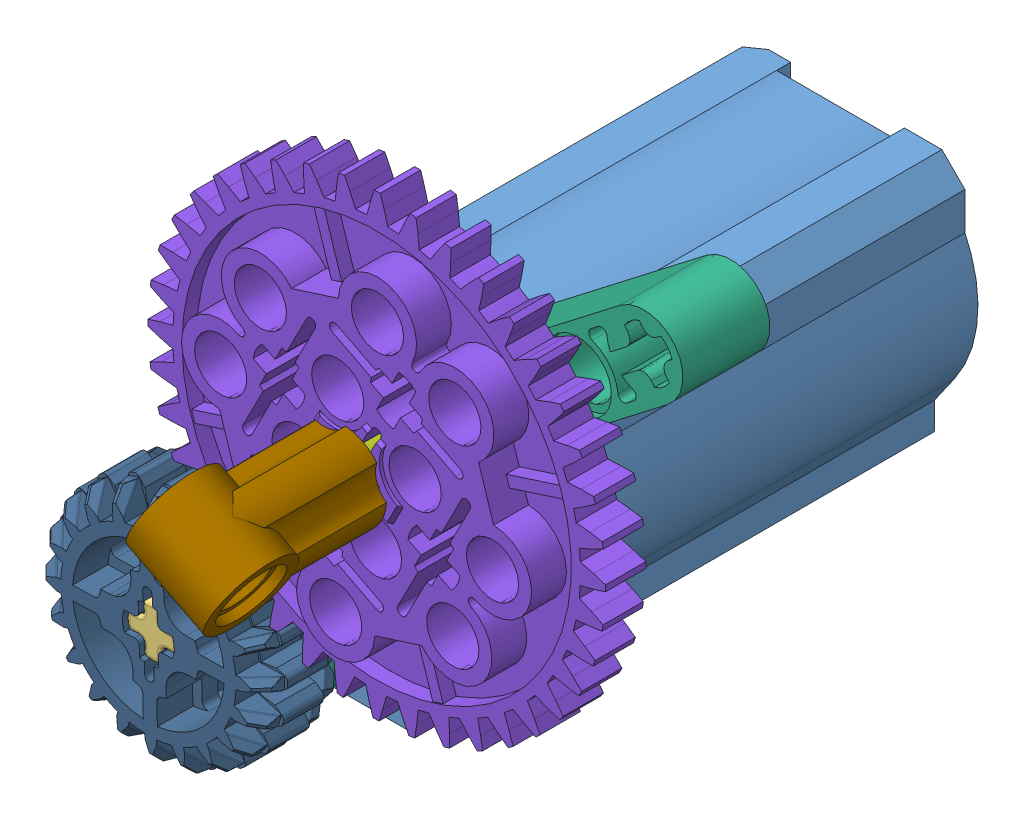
SolidWorks assembly 31.SLDASM, configuration 기본 (file format 9000). Lengths in mm.
Overall size (62.87 63.65 81.25).
10 component instances, 10 part files, 24 mates.
Components (placement in the parent):
- 9V Motor M-1: 9V Motor M.SLDPRT [기본] at (-6.7731 0.9351 48.2671) size (24 24 48.27)
- Motor 9V  PF Medium part-1: Motor 9V  PF Medium part.SLDPRT [기본] at (-4.7683 0.4462 64.2671) x (0.999659 0.026128 0) z (0 0 1) size (7 7 8)
- 4519 Axle 3-1: 4519 Axle 3.SLDPRT [기본] at (-6.7731 0.9351 88.2671) x (0.999659 0.026128 0) z (-0.026128 0.999659 0) size (4.8 24.01 4.8)
- 2780 Pin with Friction Ridges Lengthwise WITH Center Slots-1: 2780 Pin with Friction Ridges Lengthwise WITH Center Slots.SLDPRT [기본] at (-6.8431 8.9351 72.5671) x (1 0 0) z (0 -1 0) size (6 16 5.88)
- 43093 Axle Pin with Friction Ridges Lengthwise-1: 43093 Axle Pin with Friction Ridges Lengthwise.SLDPRT [기본] at (-6.7731 -7.0649 72.5671) x (0.999935 0.011435 0) z (0.011435 -0.999935 0) size (6 16 6)
- 32271 Liftarm 1 x 9 Bent (7-3) Thick-1: 32271 Liftarm 1 x 9 Bent (7-3) Thick.SLDPRT [기본] at (-6.9253 8.8716 76.4921) x (0.791702 0.610908 0) z (0 0 -1) size (64.26 19.63 8)
- 6587 Axle3 w stud-1: 6587 Axle3 w stud.SLDPRT [기본] at (12.0755 23.5334 73.5171) x (-0.889699 0.456548 0) z (0.456548 0.889699 0) size (6 26.4 6)
- 3649 Gear 40 _-1: 3649 Gear 40 _.SLDPRT [기본] at (12.0755 23.5334 84.5671) x (-0.889699 0.456548 0) z (0.456548 0.889699 0) size (42.1 8 42.1)
- 32013 Axle pin connector angled #1-1: 32013 Axle pin connector angled #1.SLDPRT [기본] at (12.0755 23.5334 89.5171) x (0 0 -1) z (-0.889699 0.456548 0) size (16 8 8)
- 32269 Gear 20 Tooth Double Bevel-1: 32269 Gear 20 Tooth Double Bevel.SLDPRT [기본] at (-6.7731 0.9351 84.5671) x (0.999659 0.026128 0) z (0.026128 -0.999659 0) size (21.33 8.11 21.33)
Mates (geometry in assembly coordinates):
- 동심1: concentric: cylinder of 9V Motor M-1 through (-6.7731 0.9351 72.2671) axis (0 0 1) radius 3.505; cylinder of Motor 9V  PF Medium part-1 through (-6.7731 0.9351 72.2671) axis (0 0 -1) radius 3.5
- 일치1: coincident: plane of 9V Motor M-1 through (-6.7731 0.9351 72.2671) normal (0 0 1); plane of Motor 9V  PF Medium part-1 through (-6.7731 0.9351 72.2671) normal (0 0 1)
- 동심2: concentric: cylinder of Motor 9V  PF Medium part-1 through (-6.7731 0.9351 72.2671) axis (0 0 -1) radius 2.4; cylinder of 4519 Axle 3-1 through (-6.7731 0.9351 64.2671) axis (0 0 1) radius 2.4
- 일치2: coincident: plane of Motor 9V  PF Medium part-1 through (-8.0756 1.7813 72.2671) normal (0.026128 -0.999659 0); plane of 4519 Axle 3-1 through (-7.6758 1.7918 64.2671) normal (-0.026128 0.999659 0)
- 일치3: coincident: circle of Motor 9V  PF Medium part-1; plane of 4519 Axle 3-1 through (-6.7731 0.9351 64.2671) normal (0 0 -1)
- 동심3: concentric: cylinder of 9V Motor M-1 through (-6.7731 -7.0649 72.2671) axis (0 0 1) radius 2.4; cylinder of 43093 Axle Pin with Friction Ridges Lengthwise-1 through (-6.7731 -7.0649 64.5671) axis (0 0 1) radius 2.4
- 일치4: coincident: plane of 9V Motor M-1 through (-4.3731 -7.0649 71.7671) normal (0 0 1); plane of 43093 Axle Pin with Friction Ridges Lengthwise-1 through (-6.7731 -7.0649 71.7671) normal (0 0 -1)
- 동심4: concentric: cylinder of 9V Motor M-1 through (-6.8431 8.9351 72.2671) axis (0 0 1) radius 2.4; cylinder of 2780 Pin with Friction Ridges Lengthwise WITH Center Slots-1 through (-6.8431 8.9351 64.5671) axis (0 0 1) radius 2.4
- 일치5: coincident: plane of 9V Motor M-1 through (-4.4431 8.9351 71.7671) normal (0 0 1); plane of 2780 Pin with Friction Ridges Lengthwise WITH Center Slots-1 through (-6.8431 8.9351 71.7671) normal (0 0 -1)
- 동심5: concentric: cylinder of 2780 Pin with Friction Ridges Lengthwise WITH Center Slots-1 through (-6.8431 8.9351 64.5671) axis (0 0 1) radius 2.4; cylinder of 32271 Liftarm 1 x 9 Bent (7-3) Thick-1 through (-6.8431 8.9351 72.5671) axis (0 0 1) radius 2.425
- 일치6: coincident: plane of 43093 Axle Pin with Friction Ridges Lengthwise-1 through (-5.8676 -9.2875 80.5671) normal (0.999935 0.011435 0); plane of 32271 Liftarm 1 x 9 Bent (7-3) Thick-1 through (-5.8664 -9.3886 72.5671) normal (-0.999935 -0.011435 0)
- 평행3: parallel: plane of 43093 Axle Pin with Friction Ridges Lengthwise-1 through (-5.4831 -7.9302 80.5671) normal (0.011435 -0.999935 0); plane of 32271 Liftarm 1 x 9 Bent (7-3) Thick-1 through (-5.8827 -7.9676 72.5671) normal (-0.011435 0.999935 0)
- 일치9: coincident: plane of 2780 Pin with Friction Ridges Lengthwise WITH Center Slots-1 through (-6.8431 8.9351 73.3671) normal (0 0 1); plane of 32271 Liftarm 1 x 9 Bent (7-3) Thick-1 through (-4.9232 10.4165 73.3671) normal (0 0 -1)
- 동심11: concentric: cylinder of 32271 Liftarm 1 x 9 Bent (7-3) Thick-1 through (12.0755 23.5334 72.5671) axis (0 0 1) radius 2.425; cylinder of 6587 Axle3 w stud-1 through (12.0755 23.5334 97.5171) axis (0 0 -1) radius 2.4
- 일치12: coincident: plane of 32271 Liftarm 1 x 9 Bent (7-3) Thick-1 through (13.9954 25.0149 73.5171) normal (0 0 -1); plane of 6587 Axle3 w stud-1 through (12.0755 23.5334 73.5171) normal (0 0 1)
- 동심12: concentric: cylinder of 6587 Axle3 w stud-1 through (12.0755 23.5334 97.5171) axis (0 0 -1) radius 2.4; cylinder of 3649 Gear 40 _-1 through (12.0755 23.5334 80.5671) axis (0 0 1) radius 2.4
- 일치13: coincident: plane of 6587 Axle3 w stud-1 through (10.4907 25.3358 97.5171) normal (0.456548 0.889699 0); plane of 3649 Gear 40 _-1 through (10.4907 25.3358 80.5671) normal (-0.456548 -0.889699 0)
- 일치14: coincident: plane of 32271 Liftarm 1 x 9 Bent (7-3) Thick-1 through (30.7955 37.9785 80.5671) normal (0 0 1); plane of 3649 Gear 40 _-1 through (17.4605 25.266 80.5671) normal (0 0 -1)
- 동심13: concentric: cylinder of 6587 Axle3 w stud-1 through (12.0755 23.5334 97.5171) axis (0 0 -1) radius 2.4; cylinder of 32013 Axle pin connector angled #1-1 through (12.0755 23.5334 105.5181) axis (0 0 -1) radius 2.4
- 일치15: coincident: plane of 6587 Axle3 w stud-1 through (10.8908 23.1522 97.5171) normal (-0.456548 -0.889699 0); plane of 32013 Axle pin connector angled #1-1 through (9.6872 23.7699 105.5181) normal (0.456548 0.889699 0)
- 탄젠트1: tangent: plane of 6587 Axle3 w stud-1 through (12.0755 23.5334 97.5171) normal (0 0 1); cylinder of 32013 Axle pin connector angled #1-1 through (15.6343 21.7072 101.5171) axis (-0.889699 0.456548 0) radius 4
- 동심14: concentric: cylinder of 4519 Axle 3-1 through (-6.7731 0.9351 64.2671) axis (0 0 1) radius 2.4; cylinder of 32269 Gear 20 Tooth Double Bevel-1 through (-6.7731 0.9351 88.6232) axis (0 0 -1) radius 2.4
- 일치16: coincident: plane of 4519 Axle 3-1 through (-8.9822 -0.003 64.2671) normal (0.026128 -0.999659 0); plane of 32269 Gear 20 Tooth Double Bevel-1 through (-7.6298 0.0324 88.6232) normal (-0.026128 0.999659 0)
- 일치17: coincident: plane of 32271 Liftarm 1 x 9 Bent (7-3) Thick-1 through (30.7955 37.9785 80.5671) normal (0 0 1); plane of 32269 Gear 20 Tooth Double Bevel-1 through (-6.7731 0.9351 80.5671) normal (0 0 -1)
